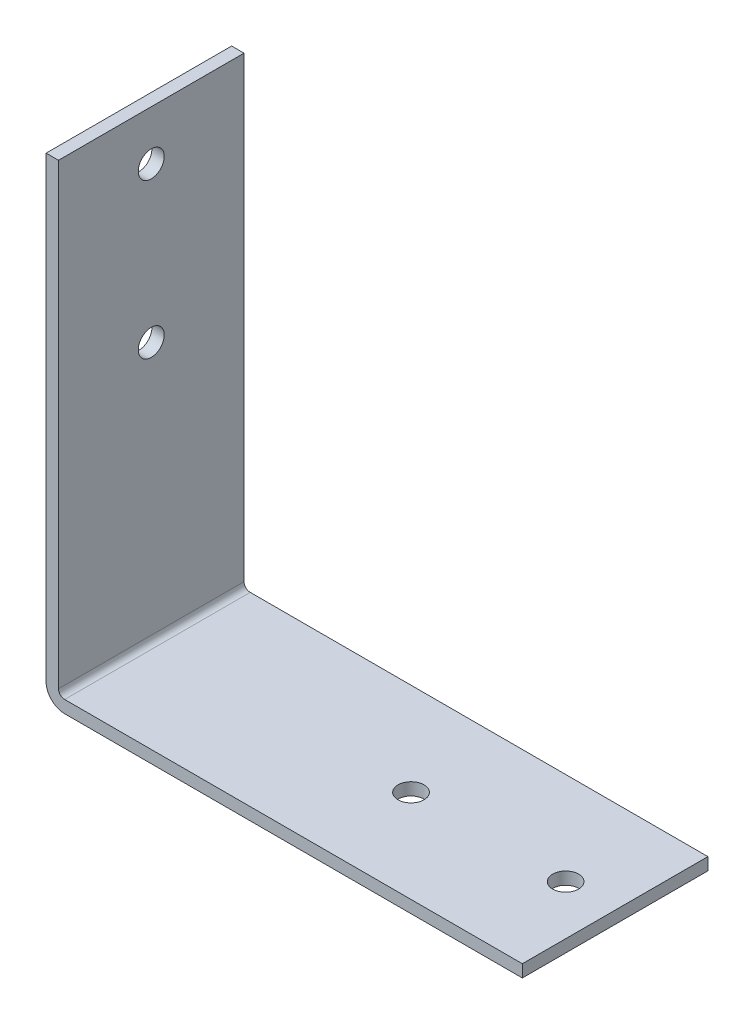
ISO-10303-21;
HEADER;
FILE_DESCRIPTION(('STEP AP214'),'2;1');
FILE_NAME('part.step','',(''),(''),'','','');
FILE_SCHEMA(('AUTOMOTIVE_DESIGN { 1 0 10303 214 1 1 1 1 }'));
ENDSEC;
DATA;
#1=APPLICATION_CONTEXT('core data for automotive mechanical design processes');
#2=APPLICATION_PROTOCOL_DEFINITION('international standard','automotive_design',2000,#1);
#3=PRODUCT_CONTEXT('',#1,'mechanical');
#4=PRODUCT('Part','Part','',(#3));
#5=PRODUCT_RELATED_PRODUCT_CATEGORY('part','',(#4));
#6=PRODUCT_DEFINITION_FORMATION('','',#4);
#7=PRODUCT_DEFINITION_CONTEXT('part definition',#1,'design');
#8=PRODUCT_DEFINITION('design','',#6,#7);
#9=PRODUCT_DEFINITION_SHAPE('','',#8);
#10=(LENGTH_UNIT() NAMED_UNIT(*) SI_UNIT(.MILLI.,.METRE.));
#11=(NAMED_UNIT(*) PLANE_ANGLE_UNIT() SI_UNIT($,.RADIAN.));
#12=(NAMED_UNIT(*) SI_UNIT($,.STERADIAN.) SOLID_ANGLE_UNIT());
#13=UNCERTAINTY_MEASURE_WITH_UNIT(LENGTH_MEASURE(1.E-05),#10,'distance_accuracy_value','');
#14=(GEOMETRIC_REPRESENTATION_CONTEXT(3) GLOBAL_UNCERTAINTY_ASSIGNED_CONTEXT((#13)) GLOBAL_UNIT_ASSIGNED_CONTEXT((#10,
#11,#12)) REPRESENTATION_CONTEXT('',''));
#15=CARTESIAN_POINT('',(0.,0.,0.));
#16=DIRECTION('',(0.,0.,1.));
#17=DIRECTION('',(1.,0.,0.));
#18=AXIS2_PLACEMENT_3D('',#15,#16,#17);
#19=CARTESIAN_POINT('',(2.,77.,-15.));
#20=DIRECTION('',(0.,1.,0.));
#21=DIRECTION('',(0.,0.,1.));
#22=AXIS2_PLACEMENT_3D('',#19,#20,#21);
#23=PLANE('',#22);
#24=DIRECTION('',(0.,0.,1.));
#25=VECTOR('',#24,1.);
#26=CARTESIAN_POINT('',(0.,77.,-15.));
#27=LINE('',#26,#25);
#28=CARTESIAN_POINT('',(0.,77.,-15.));
#29=VERTEX_POINT('',#28);
#30=CARTESIAN_POINT('',(0.,77.,15.));
#31=VERTEX_POINT('',#30);
#32=EDGE_CURVE('E95',#29,#31,#27,.T.);
#33=ORIENTED_EDGE('',*,*,#32,.T.);
#34=DIRECTION('',(-1.,0.,0.));
#35=VECTOR('',#34,1.);
#36=CARTESIAN_POINT('',(2.,77.,15.));
#37=LINE('',#36,#35);
#38=CARTESIAN_POINT('',(2.,77.,15.));
#39=VERTEX_POINT('',#38);
#40=EDGE_CURVE('E99',#39,#31,#37,.T.);
#41=ORIENTED_EDGE('',*,*,#40,.F.);
#42=DIRECTION('',(0.,0.,1.));
#43=VECTOR('',#42,1.);
#44=CARTESIAN_POINT('',(2.,77.,-15.));
#45=LINE('',#44,#43);
#46=CARTESIAN_POINT('',(2.,77.,-15.));
#47=VERTEX_POINT('',#46);
#48=EDGE_CURVE('E148',#47,#39,#45,.T.);
#49=ORIENTED_EDGE('',*,*,#48,.F.);
#50=DIRECTION('',(-1.,0.,0.));
#51=VECTOR('',#50,1.);
#52=CARTESIAN_POINT('',(2.,77.,-15.));
#53=LINE('',#52,#51);
#54=EDGE_CURVE('E101',#47,#29,#53,.T.);
#55=ORIENTED_EDGE('',*,*,#54,.T.);
#56=EDGE_LOOP('',(#33,#41,#49,#55));
#57=FACE_BOUND('',#56,.T.);
#58=ADVANCED_FACE('F32',(#57),#23,.T.);
#59=CARTESIAN_POINT('',(2.,2.,-15.));
#60=DIRECTION('',(1.,0.,0.));
#61=DIRECTION('',(0.,0.,-1.));
#62=AXIS2_PLACEMENT_3D('',#59,#60,#61);
#63=PLANE('',#62);
#64=CARTESIAN_POINT('',(2.,69.,0.));
#65=DIRECTION('',(1.,0.,0.));
#66=DIRECTION('',(0.,0.,-1.));
#67=AXIS2_PLACEMENT_3D('',#64,#65,#66);
#68=CIRCLE('',#67,2.1);
#69=CARTESIAN_POINT('',(2.,69.,-2.1));
#70=VERTEX_POINT('',#69);
#71=EDGE_CURVE('E234',#70,#70,#68,.T.);
#72=ORIENTED_EDGE('',*,*,#71,.F.);
#73=EDGE_LOOP('',(#72));
#74=FACE_BOUND('',#73,.T.);
#75=CARTESIAN_POINT('',(2.,44.,0.));
#76=DIRECTION('',(1.,0.,0.));
#77=DIRECTION('',(0.,0.,-1.));
#78=AXIS2_PLACEMENT_3D('',#75,#76,#77);
#79=CIRCLE('',#78,2.1);
#80=CARTESIAN_POINT('',(2.,44.,-2.1));
#81=VERTEX_POINT('',#80);
#82=EDGE_CURVE('E239',#81,#81,#79,.T.);
#83=ORIENTED_EDGE('',*,*,#82,.F.);
#84=EDGE_LOOP('',(#83));
#85=FACE_BOUND('',#84,.T.);
#86=DIRECTION('',(0.,1.,0.));
#87=VECTOR('',#86,1.);
#88=CARTESIAN_POINT('',(2.,2.,15.));
#89=LINE('',#88,#87);
#90=CARTESIAN_POINT('',(2.,3.,15.));
#91=VERTEX_POINT('',#90);
#92=EDGE_CURVE('E117',#91,#39,#89,.T.);
#93=ORIENTED_EDGE('',*,*,#92,.F.);
#94=DIRECTION('',(0.,0.,1.));
#95=VECTOR('',#94,1.);
#96=CARTESIAN_POINT('',(2.,3.,-15.));
#97=LINE('',#96,#95);
#98=CARTESIAN_POINT('',(2.,3.,-15.));
#99=VERTEX_POINT('',#98);
#100=EDGE_CURVE('E157',#91,#99,#97,.F.);
#101=ORIENTED_EDGE('',*,*,#100,.T.);
#102=DIRECTION('',(0.,1.,0.));
#103=VECTOR('',#102,1.);
#104=CARTESIAN_POINT('',(2.,2.,-15.));
#105=LINE('',#104,#103);
#106=EDGE_CURVE('E106',#99,#47,#105,.T.);
#107=ORIENTED_EDGE('',*,*,#106,.T.);
#108=ORIENTED_EDGE('',*,*,#48,.T.);
#109=EDGE_LOOP('',(#93,#101,#107,#108));
#110=FACE_BOUND('',#109,.T.);
#111=ADVANCED_FACE('F178',(#74,#85,#110),#63,.T.);
#112=CARTESIAN_POINT('',(77.,2.00000000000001,-15.));
#113=DIRECTION('',(0.,1.,0.));
#114=DIRECTION('',(-1.,0.,0.));
#115=AXIS2_PLACEMENT_3D('',#112,#113,#114);
#116=PLANE('',#115);
#117=CARTESIAN_POINT('',(69.,2.00000000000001,0.));
#118=DIRECTION('',(0.,1.,0.));
#119=DIRECTION('',(-1.,0.,0.));
#120=AXIS2_PLACEMENT_3D('',#117,#118,#119);
#121=CIRCLE('',#120,2.1);
#122=CARTESIAN_POINT('',(66.9,2.00000000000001,0.));
#123=VERTEX_POINT('',#122);
#124=EDGE_CURVE('E122',#123,#123,#121,.T.);
#125=ORIENTED_EDGE('',*,*,#124,.F.);
#126=EDGE_LOOP('',(#125));
#127=FACE_BOUND('',#126,.T.);
#128=CARTESIAN_POINT('',(44.,2.,0.));
#129=DIRECTION('',(0.,1.,0.));
#130=DIRECTION('',(-1.,0.,0.));
#131=AXIS2_PLACEMENT_3D('',#128,#129,#130);
#132=CIRCLE('',#131,2.1);
#133=CARTESIAN_POINT('',(41.9,2.,0.));
#134=VERTEX_POINT('',#133);
#135=EDGE_CURVE('E125',#134,#134,#132,.T.);
#136=ORIENTED_EDGE('',*,*,#135,.F.);
#137=EDGE_LOOP('',(#136));
#138=FACE_BOUND('',#137,.T.);
#139=DIRECTION('',(-1.,0.,0.));
#140=VECTOR('',#139,1.);
#141=CARTESIAN_POINT('',(77.,2.00000000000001,-15.));
#142=LINE('',#141,#140);
#143=CARTESIAN_POINT('',(77.,2.00000000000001,-15.));
#144=VERTEX_POINT('',#143);
#145=CARTESIAN_POINT('',(3.,2.,-15.));
#146=VERTEX_POINT('',#145);
#147=EDGE_CURVE('E144',#144,#146,#142,.T.);
#148=ORIENTED_EDGE('',*,*,#147,.T.);
#149=DIRECTION('',(0.,0.,1.));
#150=VECTOR('',#149,1.);
#151=CARTESIAN_POINT('',(3.,2.,15.));
#152=LINE('',#151,#150);
#153=CARTESIAN_POINT('',(3.,2.,15.));
#154=VERTEX_POINT('',#153);
#155=EDGE_CURVE('E150',#146,#154,#152,.T.);
#156=ORIENTED_EDGE('',*,*,#155,.T.);
#157=DIRECTION('',(-1.,0.,0.));
#158=VECTOR('',#157,1.);
#159=CARTESIAN_POINT('',(77.,2.00000000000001,15.));
#160=LINE('',#159,#158);
#161=CARTESIAN_POINT('',(77.,2.00000000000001,15.));
#162=VERTEX_POINT('',#161);
#163=EDGE_CURVE('E132',#162,#154,#160,.T.);
#164=ORIENTED_EDGE('',*,*,#163,.F.);
#165=DIRECTION('',(0.,0.,1.));
#166=VECTOR('',#165,1.);
#167=CARTESIAN_POINT('',(77.,2.00000000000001,-15.));
#168=LINE('',#167,#166);
#169=EDGE_CURVE('E151',#144,#162,#168,.T.);
#170=ORIENTED_EDGE('',*,*,#169,.F.);
#171=EDGE_LOOP('',(#148,#156,#164,#170));
#172=FACE_BOUND('',#171,.T.);
#173=ADVANCED_FACE('F174',(#127,#138,#172),#116,.T.);
#174=CARTESIAN_POINT('',(77.,0.,-15.));
#175=DIRECTION('',(1.,0.,0.));
#176=DIRECTION('',(0.,0.,-1.));
#177=AXIS2_PLACEMENT_3D('',#174,#175,#176);
#178=PLANE('',#177);
#179=ORIENTED_EDGE('',*,*,#169,.T.);
#180=DIRECTION('',(0.,1.,0.));
#181=VECTOR('',#180,1.);
#182=CARTESIAN_POINT('',(77.,0.,15.));
#183=LINE('',#182,#181);
#184=CARTESIAN_POINT('',(77.,0.,15.));
#185=VERTEX_POINT('',#184);
#186=EDGE_CURVE('E129',#185,#162,#183,.T.);
#187=ORIENTED_EDGE('',*,*,#186,.F.);
#188=DIRECTION('',(0.,0.,1.));
#189=VECTOR('',#188,1.);
#190=CARTESIAN_POINT('',(77.,0.,-15.));
#191=LINE('',#190,#189);
#192=CARTESIAN_POINT('',(77.,0.,-15.));
#193=VERTEX_POINT('',#192);
#194=EDGE_CURVE('E105',#193,#185,#191,.T.);
#195=ORIENTED_EDGE('',*,*,#194,.F.);
#196=DIRECTION('',(0.,1.,0.));
#197=VECTOR('',#196,1.);
#198=CARTESIAN_POINT('',(77.,0.,-15.));
#199=LINE('',#198,#197);
#200=EDGE_CURVE('E141',#193,#144,#199,.T.);
#201=ORIENTED_EDGE('',*,*,#200,.T.);
#202=EDGE_LOOP('',(#179,#187,#195,#201));
#203=FACE_BOUND('',#202,.T.);
#204=ADVANCED_FACE('F200',(#203),#178,.T.);
#205=CARTESIAN_POINT('',(0.,0.,-15.));
#206=DIRECTION('',(0.,-1.,0.));
#207=DIRECTION('',(0.,0.,-1.));
#208=AXIS2_PLACEMENT_3D('',#205,#206,#207);
#209=PLANE('',#208);
#210=CARTESIAN_POINT('',(69.,0.,0.));
#211=DIRECTION('',(0.,1.,0.));
#212=DIRECTION('',(-1.,0.,0.));
#213=AXIS2_PLACEMENT_3D('',#210,#211,#212);
#214=CIRCLE('',#213,2.1);
#215=CARTESIAN_POINT('',(66.9,0.,0.));
#216=VERTEX_POINT('',#215);
#217=EDGE_CURVE('E119',#216,#216,#214,.T.);
#218=ORIENTED_EDGE('',*,*,#217,.T.);
#219=EDGE_LOOP('',(#218));
#220=FACE_BOUND('',#219,.T.);
#221=CARTESIAN_POINT('',(44.,0.,0.));
#222=DIRECTION('',(0.,1.,0.));
#223=DIRECTION('',(-1.,0.,0.));
#224=AXIS2_PLACEMENT_3D('',#221,#222,#223);
#225=CIRCLE('',#224,2.1);
#226=CARTESIAN_POINT('',(41.9,0.,0.));
#227=VERTEX_POINT('',#226);
#228=EDGE_CURVE('E245',#227,#227,#225,.T.);
#229=ORIENTED_EDGE('',*,*,#228,.T.);
#230=EDGE_LOOP('',(#229));
#231=FACE_BOUND('',#230,.T.);
#232=DIRECTION('',(1.,0.,0.));
#233=VECTOR('',#232,1.);
#234=CARTESIAN_POINT('',(0.,0.,15.));
#235=LINE('',#234,#233);
#236=CARTESIAN_POINT('',(3.,0.,15.));
#237=VERTEX_POINT('',#236);
#238=EDGE_CURVE('E113',#237,#185,#235,.T.);
#239=ORIENTED_EDGE('',*,*,#238,.F.);
#240=DIRECTION('',(0.,0.,1.));
#241=VECTOR('',#240,1.);
#242=CARTESIAN_POINT('',(3.,0.,-15.));
#243=LINE('',#242,#241);
#244=CARTESIAN_POINT('',(3.,0.,-15.));
#245=VERTEX_POINT('',#244);
#246=EDGE_CURVE('E40',#237,#245,#243,.F.);
#247=ORIENTED_EDGE('',*,*,#246,.T.);
#248=DIRECTION('',(1.,0.,0.));
#249=VECTOR('',#248,1.);
#250=CARTESIAN_POINT('',(0.,0.,-15.));
#251=LINE('',#250,#249);
#252=EDGE_CURVE('E139',#245,#193,#251,.T.);
#253=ORIENTED_EDGE('',*,*,#252,.T.);
#254=ORIENTED_EDGE('',*,*,#194,.T.);
#255=EDGE_LOOP('',(#239,#247,#253,#254));
#256=FACE_BOUND('',#255,.T.);
#257=ADVANCED_FACE('F196',(#220,#231,#256),#209,.T.);
#258=CARTESIAN_POINT('',(0.,77.,-15.));
#259=DIRECTION('',(-1.,0.,0.));
#260=DIRECTION('',(0.,-1.,0.));
#261=AXIS2_PLACEMENT_3D('',#258,#259,#260);
#262=PLANE('',#261);
#263=CARTESIAN_POINT('',(0.,69.,0.));
#264=DIRECTION('',(1.,0.,0.));
#265=DIRECTION('',(0.,0.,-1.));
#266=AXIS2_PLACEMENT_3D('',#263,#264,#265);
#267=CIRCLE('',#266,2.1);
#268=CARTESIAN_POINT('',(0.,69.,-2.1));
#269=VERTEX_POINT('',#268);
#270=EDGE_CURVE('E231',#269,#269,#267,.T.);
#271=ORIENTED_EDGE('',*,*,#270,.T.);
#272=EDGE_LOOP('',(#271));
#273=FACE_BOUND('',#272,.T.);
#274=CARTESIAN_POINT('',(0.,44.,0.));
#275=DIRECTION('',(1.,0.,0.));
#276=DIRECTION('',(0.,0.,-1.));
#277=AXIS2_PLACEMENT_3D('',#274,#275,#276);
#278=CIRCLE('',#277,2.1);
#279=CARTESIAN_POINT('',(0.,44.,-2.1));
#280=VERTEX_POINT('',#279);
#281=EDGE_CURVE('E235',#280,#280,#278,.T.);
#282=ORIENTED_EDGE('',*,*,#281,.T.);
#283=EDGE_LOOP('',(#282));
#284=FACE_BOUND('',#283,.T.);
#285=DIRECTION('',(0.,-1.,0.));
#286=VECTOR('',#285,1.);
#287=CARTESIAN_POINT('',(0.,77.,-15.));
#288=LINE('',#287,#286);
#289=CARTESIAN_POINT('',(0.,3.,-15.));
#290=VERTEX_POINT('',#289);
#291=EDGE_CURVE('E137',#29,#290,#288,.T.);
#292=ORIENTED_EDGE('',*,*,#291,.T.);
#293=DIRECTION('',(0.,0.,1.));
#294=VECTOR('',#293,1.);
#295=CARTESIAN_POINT('',(0.,3.,-15.));
#296=LINE('',#295,#294);
#297=CARTESIAN_POINT('',(0.,3.,15.));
#298=VERTEX_POINT('',#297);
#299=EDGE_CURVE('E112',#290,#298,#296,.T.);
#300=ORIENTED_EDGE('',*,*,#299,.T.);
#301=DIRECTION('',(0.,-1.,0.));
#302=VECTOR('',#301,1.);
#303=CARTESIAN_POINT('',(0.,77.,15.));
#304=LINE('',#303,#302);
#305=EDGE_CURVE('E109',#31,#298,#304,.T.);
#306=ORIENTED_EDGE('',*,*,#305,.F.);
#307=ORIENTED_EDGE('',*,*,#32,.F.);
#308=EDGE_LOOP('',(#292,#300,#306,#307));
#309=FACE_BOUND('',#308,.T.);
#310=ADVANCED_FACE('F110',(#273,#284,#309),#262,.T.);
#311=CARTESIAN_POINT('',(0.,0.,-15.));
#312=DIRECTION('',(0.,0.,1.));
#313=DIRECTION('',(1.,0.,0.));
#314=AXIS2_PLACEMENT_3D('',#311,#312,#313);
#315=PLANE('',#314);
#316=ORIENTED_EDGE('',*,*,#252,.F.);
#317=CARTESIAN_POINT('',(3.,3.,-15.));
#318=DIRECTION('',(0.,0.,1.));
#319=DIRECTION('',(1.,0.,0.));
#320=AXIS2_PLACEMENT_3D('',#317,#318,#319);
#321=CIRCLE('',#320,3.);
#322=EDGE_CURVE('E11',#245,#290,#321,.F.);
#323=ORIENTED_EDGE('',*,*,#322,.T.);
#324=ORIENTED_EDGE('',*,*,#291,.F.);
#325=ORIENTED_EDGE('',*,*,#54,.F.);
#326=ORIENTED_EDGE('',*,*,#106,.F.);
#327=CARTESIAN_POINT('',(3.,3.,-15.));
#328=DIRECTION('',(0.,0.,1.));
#329=DIRECTION('',(1.,0.,0.));
#330=AXIS2_PLACEMENT_3D('',#327,#328,#329);
#331=CIRCLE('',#330,1.);
#332=EDGE_CURVE('E161',#99,#146,#331,.T.);
#333=ORIENTED_EDGE('',*,*,#332,.T.);
#334=ORIENTED_EDGE('',*,*,#147,.F.);
#335=ORIENTED_EDGE('',*,*,#200,.F.);
#336=EDGE_LOOP('',(#316,#323,#324,#325,#326,#333,#334,#335));
#337=FACE_BOUND('',#336,.T.);
#338=ADVANCED_FACE('F168',(#337),#315,.F.);
#339=CARTESIAN_POINT('',(0.,0.,15.));
#340=DIRECTION('',(0.,0.,1.));
#341=DIRECTION('',(1.,0.,0.));
#342=AXIS2_PLACEMENT_3D('',#339,#340,#341);
#343=PLANE('',#342);
#344=ORIENTED_EDGE('',*,*,#305,.T.);
#345=CARTESIAN_POINT('',(3.,3.,15.));
#346=DIRECTION('',(0.,0.,1.));
#347=DIRECTION('',(1.,0.,0.));
#348=AXIS2_PLACEMENT_3D('',#345,#346,#347);
#349=CIRCLE('',#348,3.);
#350=EDGE_CURVE('E54',#298,#237,#349,.T.);
#351=ORIENTED_EDGE('',*,*,#350,.T.);
#352=ORIENTED_EDGE('',*,*,#238,.T.);
#353=ORIENTED_EDGE('',*,*,#186,.T.);
#354=ORIENTED_EDGE('',*,*,#163,.T.);
#355=CARTESIAN_POINT('',(3.,3.,15.));
#356=DIRECTION('',(0.,0.,1.));
#357=DIRECTION('',(1.,0.,0.));
#358=AXIS2_PLACEMENT_3D('',#355,#356,#357);
#359=CIRCLE('',#358,1.);
#360=EDGE_CURVE('E159',#154,#91,#359,.F.);
#361=ORIENTED_EDGE('',*,*,#360,.T.);
#362=ORIENTED_EDGE('',*,*,#92,.T.);
#363=ORIENTED_EDGE('',*,*,#40,.T.);
#364=EDGE_LOOP('',(#344,#351,#352,#353,#354,#361,#362,#363));
#365=FACE_BOUND('',#364,.T.);
#366=ADVANCED_FACE('F115',(#365),#343,.T.);
#367=CARTESIAN_POINT('',(44.,0.,0.));
#368=DIRECTION('',(0.,1.,0.));
#369=DIRECTION('',(-1.,0.,0.));
#370=AXIS2_PLACEMENT_3D('',#367,#368,#369);
#371=CYLINDRICAL_SURFACE('',#370,2.1);
#372=ORIENTED_EDGE('',*,*,#228,.F.);
#373=EDGE_LOOP('',(#372));
#374=FACE_BOUND('',#373,.T.);
#375=ORIENTED_EDGE('',*,*,#135,.T.);
#376=EDGE_LOOP('',(#375));
#377=FACE_BOUND('',#376,.T.);
#378=ADVANCED_FACE('F212',(#374,#377),#371,.F.);
#379=CARTESIAN_POINT('',(69.,0.,0.));
#380=DIRECTION('',(0.,1.,0.));
#381=DIRECTION('',(-1.,0.,0.));
#382=AXIS2_PLACEMENT_3D('',#379,#380,#381);
#383=CYLINDRICAL_SURFACE('',#382,2.1);
#384=ORIENTED_EDGE('',*,*,#217,.F.);
#385=EDGE_LOOP('',(#384));
#386=FACE_BOUND('',#385,.T.);
#387=ORIENTED_EDGE('',*,*,#124,.T.);
#388=EDGE_LOOP('',(#387));
#389=FACE_BOUND('',#388,.T.);
#390=ADVANCED_FACE('F215',(#386,#389),#383,.F.);
#391=CARTESIAN_POINT('',(0.,44.,0.));
#392=DIRECTION('',(1.,0.,0.));
#393=DIRECTION('',(0.,0.,-1.));
#394=AXIS2_PLACEMENT_3D('',#391,#392,#393);
#395=CYLINDRICAL_SURFACE('',#394,2.1);
#396=ORIENTED_EDGE('',*,*,#281,.F.);
#397=EDGE_LOOP('',(#396));
#398=FACE_BOUND('',#397,.T.);
#399=ORIENTED_EDGE('',*,*,#82,.T.);
#400=EDGE_LOOP('',(#399));
#401=FACE_BOUND('',#400,.T.);
#402=ADVANCED_FACE('F219',(#398,#401),#395,.F.);
#403=CARTESIAN_POINT('',(0.,69.,0.));
#404=DIRECTION('',(1.,0.,0.));
#405=DIRECTION('',(0.,0.,-1.));
#406=AXIS2_PLACEMENT_3D('',#403,#404,#405);
#407=CYLINDRICAL_SURFACE('',#406,2.1);
#408=ORIENTED_EDGE('',*,*,#270,.F.);
#409=EDGE_LOOP('',(#408));
#410=FACE_BOUND('',#409,.T.);
#411=ORIENTED_EDGE('',*,*,#71,.T.);
#412=EDGE_LOOP('',(#411));
#413=FACE_BOUND('',#412,.T.);
#414=ADVANCED_FACE('F185',(#410,#413),#407,.F.);
#415=CARTESIAN_POINT('',(3.,3.,-15.));
#416=DIRECTION('',(0.,0.,-1.));
#417=DIRECTION('',(-1.,0.,0.));
#418=AXIS2_PLACEMENT_3D('',#415,#416,#417);
#419=CYLINDRICAL_SURFACE('',#418,1.);
#420=ORIENTED_EDGE('',*,*,#332,.F.);
#421=ORIENTED_EDGE('',*,*,#100,.F.);
#422=ORIENTED_EDGE('',*,*,#360,.F.);
#423=ORIENTED_EDGE('',*,*,#155,.F.);
#424=EDGE_LOOP('',(#420,#421,#422,#423));
#425=FACE_BOUND('',#424,.T.);
#426=ADVANCED_FACE('F176',(#425),#419,.F.);
#427=CARTESIAN_POINT('',(3.,3.,-15.));
#428=DIRECTION('',(0.,0.,1.));
#429=DIRECTION('',(1.,0.,0.));
#430=AXIS2_PLACEMENT_3D('',#427,#428,#429);
#431=CYLINDRICAL_SURFACE('',#430,3.);
#432=ORIENTED_EDGE('',*,*,#322,.F.);
#433=ORIENTED_EDGE('',*,*,#246,.F.);
#434=ORIENTED_EDGE('',*,*,#350,.F.);
#435=ORIENTED_EDGE('',*,*,#299,.F.);
#436=EDGE_LOOP('',(#432,#433,#434,#435));
#437=FACE_BOUND('',#436,.T.);
#438=ADVANCED_FACE('F34',(#437),#431,.T.);
#439=CLOSED_SHELL('',(#58,#111,#173,#204,#257,#310,#338,#366,#378,#390,#402,#414,#426,#438));
#440=MANIFOLD_SOLID_BREP('B2',#439);
#441=ADVANCED_BREP_SHAPE_REPRESENTATION('',(#18,#440),#14);
#442=SHAPE_DEFINITION_REPRESENTATION(#9,#441);
ENDSEC;
END-ISO-10303-21;
